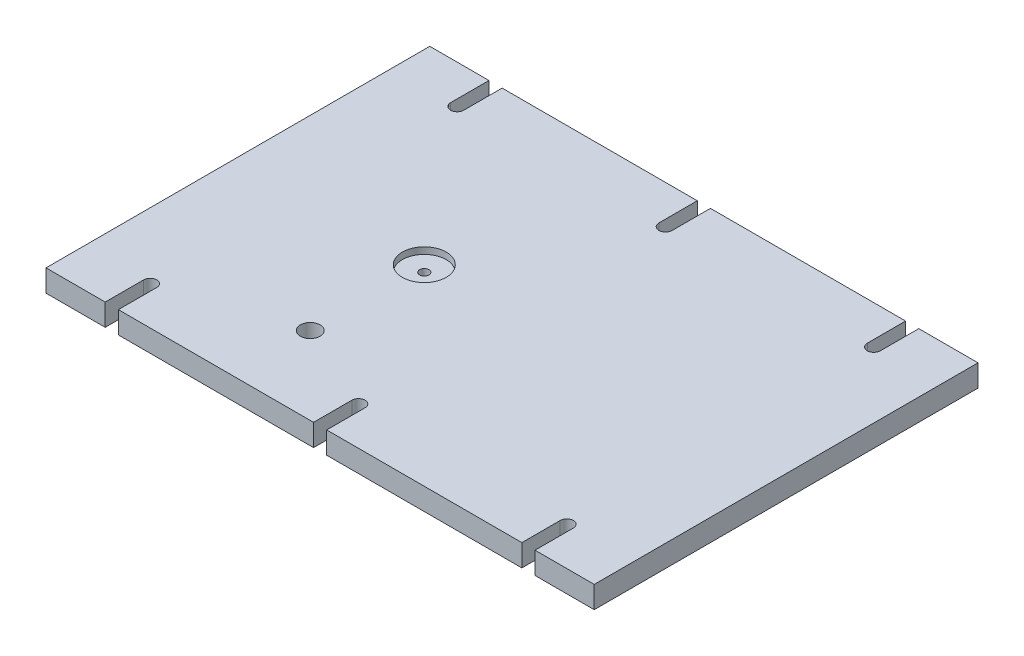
ISO-10303-21;
HEADER;
FILE_DESCRIPTION(('STEP AP214'),'2;1');
FILE_NAME('part.step','',(''),(''),'','','');
FILE_SCHEMA(('AUTOMOTIVE_DESIGN { 1 0 10303 214 1 1 1 1 }'));
ENDSEC;
DATA;
#1=APPLICATION_CONTEXT('core data for automotive mechanical design processes');
#2=APPLICATION_PROTOCOL_DEFINITION('international standard','automotive_design',2000,#1);
#3=PRODUCT_CONTEXT('',#1,'mechanical');
#4=PRODUCT('Part','Part','',(#3));
#5=PRODUCT_RELATED_PRODUCT_CATEGORY('part','',(#4));
#6=PRODUCT_DEFINITION_FORMATION('','',#4);
#7=PRODUCT_DEFINITION_CONTEXT('part definition',#1,'design');
#8=PRODUCT_DEFINITION('design','',#6,#7);
#9=PRODUCT_DEFINITION_SHAPE('','',#8);
#10=(LENGTH_UNIT() NAMED_UNIT(*) SI_UNIT(.MILLI.,.METRE.));
#11=(NAMED_UNIT(*) PLANE_ANGLE_UNIT() SI_UNIT($,.RADIAN.));
#12=(NAMED_UNIT(*) SI_UNIT($,.STERADIAN.) SOLID_ANGLE_UNIT());
#13=UNCERTAINTY_MEASURE_WITH_UNIT(LENGTH_MEASURE(1.E-05),#10,'distance_accuracy_value','');
#14=(GEOMETRIC_REPRESENTATION_CONTEXT(3) GLOBAL_UNCERTAINTY_ASSIGNED_CONTEXT((#13)) GLOBAL_UNIT_ASSIGNED_CONTEXT((#10,
#11,#12)) REPRESENTATION_CONTEXT('',''));
#15=CARTESIAN_POINT('',(0.,0.,0.));
#16=DIRECTION('',(0.,0.,1.));
#17=DIRECTION('',(1.,0.,0.));
#18=AXIS2_PLACEMENT_3D('',#15,#16,#17);
#19=CARTESIAN_POINT('',(-200.,-20.,-175.));
#20=DIRECTION('',(0.,0.,1.));
#21=DIRECTION('',(1.,0.,0.));
#22=AXIS2_PLACEMENT_3D('',#19,#20,#21);
#23=PLANE('',#22);
#24=DIRECTION('',(-1.,0.,0.));
#25=VECTOR('',#24,1.);
#26=CARTESIAN_POINT('',(-200.,0.,-175.));
#27=LINE('',#26,#25);
#28=CARTESIAN_POINT('',(43.9999999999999,0.,-175.));
#29=VERTEX_POINT('',#28);
#30=CARTESIAN_POINT('',(-134.,0.,-175.));
#31=VERTEX_POINT('',#30);
#32=EDGE_CURVE('E430',#29,#31,#27,.T.);
#33=ORIENTED_EDGE('',*,*,#32,.F.);
#34=DIRECTION('',(0.,1.,0.));
#35=VECTOR('',#34,1.);
#36=CARTESIAN_POINT('',(43.9999999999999,-20.,-175.));
#37=LINE('',#36,#35);
#38=CARTESIAN_POINT('',(43.9999999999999,-20.,-175.));
#39=VERTEX_POINT('',#38);
#40=EDGE_CURVE('E249',#39,#29,#37,.T.);
#41=ORIENTED_EDGE('',*,*,#40,.F.);
#42=DIRECTION('',(1.,0.,0.));
#43=VECTOR('',#42,1.);
#44=CARTESIAN_POINT('',(-200.,-20.,-175.));
#45=LINE('',#44,#43);
#46=CARTESIAN_POINT('',(-134.,-20.,-175.));
#47=VERTEX_POINT('',#46);
#48=EDGE_CURVE('E423',#47,#39,#45,.T.);
#49=ORIENTED_EDGE('',*,*,#48,.F.);
#50=DIRECTION('',(0.,1.,0.));
#51=VECTOR('',#50,1.);
#52=CARTESIAN_POINT('',(-134.,-20.,-175.));
#53=LINE('',#52,#51);
#54=EDGE_CURVE('E298',#47,#31,#53,.T.);
#55=ORIENTED_EDGE('',*,*,#54,.T.);
#56=EDGE_LOOP('',(#33,#41,#49,#55));
#57=FACE_BOUND('',#56,.T.);
#58=ADVANCED_FACE('F33',(#57),#23,.F.);
#59=CARTESIAN_POINT('',(-200.,-20.,175.));
#60=DIRECTION('',(0.,0.,1.));
#61=DIRECTION('',(1.,0.,0.));
#62=AXIS2_PLACEMENT_3D('',#59,#60,#61);
#63=PLANE('',#62);
#64=DIRECTION('',(0.,1.,0.));
#65=VECTOR('',#64,1.);
#66=CARTESIAN_POINT('',(44.,-20.,175.));
#67=LINE('',#66,#65);
#68=CARTESIAN_POINT('',(44.,-20.,175.));
#69=VERTEX_POINT('',#68);
#70=CARTESIAN_POINT('',(44.,0.,175.));
#71=VERTEX_POINT('',#70);
#72=EDGE_CURVE('E260',#69,#71,#67,.T.);
#73=ORIENTED_EDGE('',*,*,#72,.T.);
#74=DIRECTION('',(-1.,0.,0.));
#75=VECTOR('',#74,1.);
#76=CARTESIAN_POINT('',(-200.,0.,175.));
#77=LINE('',#76,#75);
#78=CARTESIAN_POINT('',(-134.,0.,175.));
#79=VERTEX_POINT('',#78);
#80=EDGE_CURVE('E415',#71,#79,#77,.T.);
#81=ORIENTED_EDGE('',*,*,#80,.T.);
#82=DIRECTION('',(0.,1.,0.));
#83=VECTOR('',#82,1.);
#84=CARTESIAN_POINT('',(-134.,-20.,175.));
#85=LINE('',#84,#83);
#86=CARTESIAN_POINT('',(-134.,-20.,175.));
#87=VERTEX_POINT('',#86);
#88=EDGE_CURVE('E377',#87,#79,#85,.T.);
#89=ORIENTED_EDGE('',*,*,#88,.F.);
#90=DIRECTION('',(1.,0.,0.));
#91=VECTOR('',#90,1.);
#92=CARTESIAN_POINT('',(-200.,-20.,175.));
#93=LINE('',#92,#91);
#94=EDGE_CURVE('E406',#87,#69,#93,.T.);
#95=ORIENTED_EDGE('',*,*,#94,.T.);
#96=EDGE_LOOP('',(#73,#81,#89,#95));
#97=FACE_BOUND('',#96,.T.);
#98=ADVANCED_FACE('F462',(#97),#63,.T.);
#99=CARTESIAN_POINT('',(-146.,0.,-175.));
#100=VERTEX_POINT('',#99);
#101=CARTESIAN_POINT('',(-200.,0.,-175.));
#102=VERTEX_POINT('',#101);
#103=EDGE_CURVE('E426',#100,#102,#27,.T.);
#104=ORIENTED_EDGE('',*,*,#103,.F.);
#105=DIRECTION('',(0.,1.,0.));
#106=VECTOR('',#105,1.);
#107=CARTESIAN_POINT('',(-146.,-20.,-175.));
#108=LINE('',#107,#106);
#109=CARTESIAN_POINT('',(-146.,-20.,-175.));
#110=VERTEX_POINT('',#109);
#111=EDGE_CURVE('E296',#110,#100,#108,.T.);
#112=ORIENTED_EDGE('',*,*,#111,.F.);
#113=CARTESIAN_POINT('',(-200.,-20.,-175.));
#114=VERTEX_POINT('',#113);
#115=EDGE_CURVE('E419',#114,#110,#45,.T.);
#116=ORIENTED_EDGE('',*,*,#115,.F.);
#117=DIRECTION('',(0.,-1.,0.));
#118=VECTOR('',#117,1.);
#119=CARTESIAN_POINT('',(-200.,0.,-175.));
#120=LINE('',#119,#118);
#121=EDGE_CURVE('E396',#102,#114,#120,.T.);
#122=ORIENTED_EDGE('',*,*,#121,.F.);
#123=EDGE_LOOP('',(#104,#112,#116,#122));
#124=FACE_BOUND('',#123,.T.);
#125=ADVANCED_FACE('F508',(#124),#23,.F.);
#126=CARTESIAN_POINT('',(55.9999999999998,-20.,-175.));
#127=VERTEX_POINT('',#126);
#128=CARTESIAN_POINT('',(234.,-20.,-175.));
#129=VERTEX_POINT('',#128);
#130=EDGE_CURVE('E424',#127,#129,#45,.T.);
#131=ORIENTED_EDGE('',*,*,#130,.F.);
#132=DIRECTION('',(0.,1.,0.));
#133=VECTOR('',#132,1.);
#134=CARTESIAN_POINT('',(55.9999999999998,-20.,-175.));
#135=LINE('',#134,#133);
#136=CARTESIAN_POINT('',(55.9999999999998,0.,-175.));
#137=VERTEX_POINT('',#136);
#138=EDGE_CURVE('E225',#127,#137,#135,.T.);
#139=ORIENTED_EDGE('',*,*,#138,.T.);
#140=CARTESIAN_POINT('',(234.,0.,-175.));
#141=VERTEX_POINT('',#140);
#142=EDGE_CURVE('E429',#141,#137,#27,.T.);
#143=ORIENTED_EDGE('',*,*,#142,.F.);
#144=DIRECTION('',(0.,1.,0.));
#145=VECTOR('',#144,1.);
#146=CARTESIAN_POINT('',(234.,-20.,-175.));
#147=LINE('',#146,#145);
#148=EDGE_CURVE('E323',#129,#141,#147,.T.);
#149=ORIENTED_EDGE('',*,*,#148,.F.);
#150=EDGE_LOOP('',(#131,#139,#143,#149));
#151=FACE_BOUND('',#150,.T.);
#152=ADVANCED_FACE('F517',(#151),#23,.F.);
#153=DIRECTION('',(0.,1.,0.));
#154=VECTOR('',#153,1.);
#155=CARTESIAN_POINT('',(246.,-20.,175.));
#156=LINE('',#155,#154);
#157=CARTESIAN_POINT('',(246.,-20.,175.));
#158=VERTEX_POINT('',#157);
#159=CARTESIAN_POINT('',(246.,0.,175.));
#160=VERTEX_POINT('',#159);
#161=EDGE_CURVE('E349',#158,#160,#156,.T.);
#162=ORIENTED_EDGE('',*,*,#161,.F.);
#163=CARTESIAN_POINT('',(300.,-20.,175.));
#164=VERTEX_POINT('',#163);
#165=EDGE_CURVE('E400',#158,#164,#93,.T.);
#166=ORIENTED_EDGE('',*,*,#165,.T.);
#167=DIRECTION('',(0.,1.,0.));
#168=VECTOR('',#167,1.);
#169=CARTESIAN_POINT('',(300.,0.,175.));
#170=LINE('',#169,#168);
#171=CARTESIAN_POINT('',(300.,0.,175.));
#172=VERTEX_POINT('',#171);
#173=EDGE_CURVE('E405',#164,#172,#170,.T.);
#174=ORIENTED_EDGE('',*,*,#173,.T.);
#175=EDGE_CURVE('E410',#172,#160,#77,.T.);
#176=ORIENTED_EDGE('',*,*,#175,.T.);
#177=EDGE_LOOP('',(#162,#166,#174,#176));
#178=FACE_BOUND('',#177,.T.);
#179=ADVANCED_FACE('F457',(#178),#63,.T.);
#180=DIRECTION('',(0.,1.,0.));
#181=VECTOR('',#180,1.);
#182=CARTESIAN_POINT('',(-146.,-20.,175.));
#183=LINE('',#182,#181);
#184=CARTESIAN_POINT('',(-146.,-20.,175.));
#185=VERTEX_POINT('',#184);
#186=CARTESIAN_POINT('',(-146.,0.,175.));
#187=VERTEX_POINT('',#186);
#188=EDGE_CURVE('E365',#185,#187,#183,.T.);
#189=ORIENTED_EDGE('',*,*,#188,.T.);
#190=CARTESIAN_POINT('',(-200.,0.,175.));
#191=VERTEX_POINT('',#190);
#192=EDGE_CURVE('E409',#187,#191,#77,.T.);
#193=ORIENTED_EDGE('',*,*,#192,.T.);
#194=DIRECTION('',(0.,-1.,0.));
#195=VECTOR('',#194,1.);
#196=CARTESIAN_POINT('',(-200.,0.,175.));
#197=LINE('',#196,#195);
#198=CARTESIAN_POINT('',(-200.,-20.,175.));
#199=VERTEX_POINT('',#198);
#200=EDGE_CURVE('E397',#191,#199,#197,.T.);
#201=ORIENTED_EDGE('',*,*,#200,.T.);
#202=EDGE_CURVE('E402',#199,#185,#93,.T.);
#203=ORIENTED_EDGE('',*,*,#202,.T.);
#204=EDGE_LOOP('',(#189,#193,#201,#203));
#205=FACE_BOUND('',#204,.T.);
#206=ADVANCED_FACE('F477',(#205),#63,.T.);
#207=CARTESIAN_POINT('',(-30.,0.,0.));
#208=DIRECTION('',(0.,1.,0.));
#209=DIRECTION('',(0.,0.,1.));
#210=AXIS2_PLACEMENT_3D('',#207,#208,#209);
#211=CYLINDRICAL_SURFACE('',#210,4.24999999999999);
#212=CARTESIAN_POINT('',(-30.,-20.,0.));
#213=DIRECTION('',(0.,1.,0.));
#214=DIRECTION('',(0.,0.,1.));
#215=AXIS2_PLACEMENT_3D('',#212,#213,#214);
#216=CIRCLE('',#215,4.25);
#217=CARTESIAN_POINT('',(-30.,-20.,4.24999999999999));
#218=VERTEX_POINT('',#217);
#219=EDGE_CURVE('E390',#218,#218,#216,.T.);
#220=ORIENTED_EDGE('',*,*,#219,.F.);
#221=EDGE_LOOP('',(#220));
#222=FACE_BOUND('',#221,.T.);
#223=CARTESIAN_POINT('',(-30.,-6.,0.));
#224=DIRECTION('',(0.,1.,0.));
#225=DIRECTION('',(0.,0.,1.));
#226=AXIS2_PLACEMENT_3D('',#223,#224,#225);
#227=CIRCLE('',#226,4.24999999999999);
#228=CARTESIAN_POINT('',(-30.,-6.,4.24999999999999));
#229=VERTEX_POINT('',#228);
#230=EDGE_CURVE('E37',#229,#229,#227,.F.);
#231=ORIENTED_EDGE('',*,*,#230,.F.);
#232=EDGE_LOOP('',(#231));
#233=FACE_BOUND('',#232,.T.);
#234=ADVANCED_FACE('F730',(#222,#233),#211,.F.);
#235=CARTESIAN_POINT('',(-200.,0.,175.));
#236=DIRECTION('',(1.,0.,0.));
#237=DIRECTION('',(0.,0.,-1.));
#238=AXIS2_PLACEMENT_3D('',#235,#236,#237);
#239=PLANE('',#238);
#240=ORIENTED_EDGE('',*,*,#121,.T.);
#241=DIRECTION('',(0.,0.,-1.));
#242=VECTOR('',#241,1.);
#243=CARTESIAN_POINT('',(-200.,-20.,175.));
#244=LINE('',#243,#242);
#245=EDGE_CURVE('E11',#199,#114,#244,.T.);
#246=ORIENTED_EDGE('',*,*,#245,.F.);
#247=ORIENTED_EDGE('',*,*,#200,.F.);
#248=DIRECTION('',(0.,0.,-1.));
#249=VECTOR('',#248,1.);
#250=CARTESIAN_POINT('',(-200.,0.,175.));
#251=LINE('',#250,#249);
#252=EDGE_CURVE('E413',#191,#102,#251,.T.);
#253=ORIENTED_EDGE('',*,*,#252,.T.);
#254=EDGE_LOOP('',(#240,#246,#247,#253));
#255=FACE_BOUND('',#254,.T.);
#256=ADVANCED_FACE('F35',(#255),#239,.F.);
#257=CARTESIAN_POINT('',(-200.,-20.,175.));
#258=DIRECTION('',(0.,1.,0.));
#259=DIRECTION('',(0.,0.,1.));
#260=AXIS2_PLACEMENT_3D('',#257,#258,#259);
#261=PLANE('',#260);
#262=CARTESIAN_POINT('',(-30.,-20.,104.));
#263=DIRECTION('',(0.,1.,0.));
#264=DIRECTION('',(0.,0.,1.));
#265=AXIS2_PLACEMENT_3D('',#262,#263,#264);
#266=CIRCLE('',#265,8.99999999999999);
#267=CARTESIAN_POINT('',(-30.,-20.,113.));
#268=VERTEX_POINT('',#267);
#269=EDGE_CURVE('E387',#268,#268,#266,.T.);
#270=ORIENTED_EDGE('',*,*,#269,.T.);
#271=EDGE_LOOP('',(#270));
#272=FACE_BOUND('',#271,.T.);
#273=ORIENTED_EDGE('',*,*,#219,.T.);
#274=EDGE_LOOP('',(#273));
#275=FACE_BOUND('',#274,.T.);
#276=ORIENTED_EDGE('',*,*,#48,.T.);
#277=DIRECTION('',(0.,0.,1.));
#278=VECTOR('',#277,1.);
#279=CARTESIAN_POINT('',(43.9999999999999,-20.,-175.));
#280=LINE('',#279,#278);
#281=CARTESIAN_POINT('',(44.,-20.,-140.));
#282=VERTEX_POINT('',#281);
#283=EDGE_CURVE('E226',#39,#282,#280,.T.);
#284=ORIENTED_EDGE('',*,*,#283,.T.);
#285=CARTESIAN_POINT('',(50.,-20.,-140.));
#286=DIRECTION('',(0.,1.,0.));
#287=DIRECTION('',(0.,0.,-1.));
#288=AXIS2_PLACEMENT_3D('',#285,#286,#287);
#289=CIRCLE('',#288,6.00000000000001);
#290=CARTESIAN_POINT('',(56.,-20.,-140.));
#291=VERTEX_POINT('',#290);
#292=EDGE_CURVE('E221',#282,#291,#289,.T.);
#293=ORIENTED_EDGE('',*,*,#292,.T.);
#294=DIRECTION('',(0.,0.,-1.));
#295=VECTOR('',#294,1.);
#296=CARTESIAN_POINT('',(55.9999999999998,-20.,-175.));
#297=LINE('',#296,#295);
#298=EDGE_CURVE('E229',#291,#127,#297,.T.);
#299=ORIENTED_EDGE('',*,*,#298,.T.);
#300=ORIENTED_EDGE('',*,*,#130,.T.);
#301=DIRECTION('',(0.,0.,1.));
#302=VECTOR('',#301,1.);
#303=CARTESIAN_POINT('',(234.,-20.,-175.));
#304=LINE('',#303,#302);
#305=CARTESIAN_POINT('',(234.,-20.,-140.));
#306=VERTEX_POINT('',#305);
#307=EDGE_CURVE('E310',#129,#306,#304,.T.);
#308=ORIENTED_EDGE('',*,*,#307,.T.);
#309=CARTESIAN_POINT('',(240.,-20.,-140.));
#310=DIRECTION('',(0.,1.,0.));
#311=DIRECTION('',(0.,0.,-1.));
#312=AXIS2_PLACEMENT_3D('',#309,#310,#311);
#313=CIRCLE('',#312,6.00000000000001);
#314=CARTESIAN_POINT('',(246.,-20.,-140.));
#315=VERTEX_POINT('',#314);
#316=EDGE_CURVE('E303',#306,#315,#313,.T.);
#317=ORIENTED_EDGE('',*,*,#316,.T.);
#318=DIRECTION('',(0.,0.,-1.));
#319=VECTOR('',#318,1.);
#320=CARTESIAN_POINT('',(246.,-20.,-175.));
#321=LINE('',#320,#319);
#322=CARTESIAN_POINT('',(246.,-20.,-175.));
#323=VERTEX_POINT('',#322);
#324=EDGE_CURVE('E306',#315,#323,#321,.T.);
#325=ORIENTED_EDGE('',*,*,#324,.T.);
#326=CARTESIAN_POINT('',(300.,-20.,-175.));
#327=VERTEX_POINT('',#326);
#328=EDGE_CURVE('E418',#323,#327,#45,.T.);
#329=ORIENTED_EDGE('',*,*,#328,.T.);
#330=DIRECTION('',(0.,0.,-1.));
#331=VECTOR('',#330,1.);
#332=CARTESIAN_POINT('',(300.,-20.,175.));
#333=LINE('',#332,#331);
#334=EDGE_CURVE('E42',#164,#327,#333,.T.);
#335=ORIENTED_EDGE('',*,*,#334,.F.);
#336=ORIENTED_EDGE('',*,*,#165,.F.);
#337=DIRECTION('',(0.,0.,-1.));
#338=VECTOR('',#337,1.);
#339=CARTESIAN_POINT('',(246.,-20.,175.));
#340=LINE('',#339,#338);
#341=CARTESIAN_POINT('',(246.,-20.,140.));
#342=VERTEX_POINT('',#341);
#343=EDGE_CURVE('E336',#158,#342,#340,.T.);
#344=ORIENTED_EDGE('',*,*,#343,.T.);
#345=CARTESIAN_POINT('',(240.,-20.,140.));
#346=DIRECTION('',(0.,1.,0.));
#347=DIRECTION('',(0.,0.,1.));
#348=AXIS2_PLACEMENT_3D('',#345,#346,#347);
#349=CIRCLE('',#348,6.00000000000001);
#350=CARTESIAN_POINT('',(234.,-20.,140.));
#351=VERTEX_POINT('',#350);
#352=EDGE_CURVE('E329',#342,#351,#349,.T.);
#353=ORIENTED_EDGE('',*,*,#352,.T.);
#354=DIRECTION('',(0.,0.,1.));
#355=VECTOR('',#354,1.);
#356=CARTESIAN_POINT('',(234.,-20.,175.));
#357=LINE('',#356,#355);
#358=CARTESIAN_POINT('',(234.,-20.,175.));
#359=VERTEX_POINT('',#358);
#360=EDGE_CURVE('E332',#351,#359,#357,.T.);
#361=ORIENTED_EDGE('',*,*,#360,.T.);
#362=CARTESIAN_POINT('',(56.,-20.,175.));
#363=VERTEX_POINT('',#362);
#364=EDGE_CURVE('E407',#363,#359,#93,.T.);
#365=ORIENTED_EDGE('',*,*,#364,.F.);
#366=DIRECTION('',(0.,0.,-1.));
#367=VECTOR('',#366,1.);
#368=CARTESIAN_POINT('',(56.,-20.,175.));
#369=LINE('',#368,#367);
#370=CARTESIAN_POINT('',(56.,-20.,140.));
#371=VERTEX_POINT('',#370);
#372=EDGE_CURVE('E57',#363,#371,#369,.T.);
#373=ORIENTED_EDGE('',*,*,#372,.T.);
#374=CARTESIAN_POINT('',(50.,-20.,140.));
#375=DIRECTION('',(0.,1.,0.));
#376=DIRECTION('',(0.,0.,1.));
#377=AXIS2_PLACEMENT_3D('',#374,#375,#376);
#378=CIRCLE('',#377,6.00000000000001);
#379=CARTESIAN_POINT('',(44.,-20.,140.));
#380=VERTEX_POINT('',#379);
#381=EDGE_CURVE('E257',#371,#380,#378,.T.);
#382=ORIENTED_EDGE('',*,*,#381,.T.);
#383=DIRECTION('',(0.,0.,1.));
#384=VECTOR('',#383,1.);
#385=CARTESIAN_POINT('',(44.,-20.,175.));
#386=LINE('',#385,#384);
#387=EDGE_CURVE('E252',#380,#69,#386,.T.);
#388=ORIENTED_EDGE('',*,*,#387,.T.);
#389=ORIENTED_EDGE('',*,*,#94,.F.);
#390=DIRECTION('',(0.,0.,-1.));
#391=VECTOR('',#390,1.);
#392=CARTESIAN_POINT('',(-134.,-20.,175.));
#393=LINE('',#392,#391);
#394=CARTESIAN_POINT('',(-134.,-20.,140.));
#395=VERTEX_POINT('',#394);
#396=EDGE_CURVE('E358',#87,#395,#393,.T.);
#397=ORIENTED_EDGE('',*,*,#396,.T.);
#398=CARTESIAN_POINT('',(-140.,-20.,140.));
#399=DIRECTION('',(0.,1.,0.));
#400=DIRECTION('',(0.,0.,-1.));
#401=AXIS2_PLACEMENT_3D('',#398,#399,#400);
#402=CIRCLE('',#401,6.00000000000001);
#403=CARTESIAN_POINT('',(-146.,-20.,140.));
#404=VERTEX_POINT('',#403);
#405=EDGE_CURVE('E362',#395,#404,#402,.T.);
#406=ORIENTED_EDGE('',*,*,#405,.T.);
#407=DIRECTION('',(0.,0.,1.));
#408=VECTOR('',#407,1.);
#409=CARTESIAN_POINT('',(-146.,-20.,175.));
#410=LINE('',#409,#408);
#411=EDGE_CURVE('E355',#404,#185,#410,.T.);
#412=ORIENTED_EDGE('',*,*,#411,.T.);
#413=ORIENTED_EDGE('',*,*,#202,.F.);
#414=ORIENTED_EDGE('',*,*,#245,.T.);
#415=ORIENTED_EDGE('',*,*,#115,.T.);
#416=DIRECTION('',(0.,0.,1.));
#417=VECTOR('',#416,1.);
#418=CARTESIAN_POINT('',(-146.,-20.,-175.));
#419=LINE('',#418,#417);
#420=CARTESIAN_POINT('',(-146.,-20.,-140.));
#421=VERTEX_POINT('',#420);
#422=EDGE_CURVE('E283',#110,#421,#419,.T.);
#423=ORIENTED_EDGE('',*,*,#422,.T.);
#424=CARTESIAN_POINT('',(-140.,-20.,-140.));
#425=DIRECTION('',(0.,1.,0.));
#426=DIRECTION('',(0.,0.,1.));
#427=AXIS2_PLACEMENT_3D('',#424,#425,#426);
#428=CIRCLE('',#427,6.00000000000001);
#429=CARTESIAN_POINT('',(-134.,-20.,-140.));
#430=VERTEX_POINT('',#429);
#431=EDGE_CURVE('E276',#421,#430,#428,.T.);
#432=ORIENTED_EDGE('',*,*,#431,.T.);
#433=DIRECTION('',(0.,0.,-1.));
#434=VECTOR('',#433,1.);
#435=CARTESIAN_POINT('',(-134.,-20.,-175.));
#436=LINE('',#435,#434);
#437=EDGE_CURVE('E279',#430,#47,#436,.T.);
#438=ORIENTED_EDGE('',*,*,#437,.T.);
#439=EDGE_LOOP('',(#276,#284,#293,#299,#300,#308,#317,#325,#329,#335,#336,#344,#353,#361,#365,
#373,#382,#388,#389,#397,#406,#412,#413,#414,#415,#423,#432,#438));
#440=FACE_BOUND('',#439,.T.);
#441=ADVANCED_FACE('F236',(#272,#275,#440),#261,.F.);
#442=CARTESIAN_POINT('',(300.,0.,175.));
#443=DIRECTION('',(-1.,0.,0.));
#444=DIRECTION('',(0.,0.,1.));
#445=AXIS2_PLACEMENT_3D('',#442,#443,#444);
#446=PLANE('',#445);
#447=DIRECTION('',(0.,1.,0.));
#448=VECTOR('',#447,1.);
#449=CARTESIAN_POINT('',(300.,0.,-175.));
#450=LINE('',#449,#448);
#451=CARTESIAN_POINT('',(300.,0.,-175.));
#452=VERTEX_POINT('',#451);
#453=EDGE_CURVE('E422',#327,#452,#450,.T.);
#454=ORIENTED_EDGE('',*,*,#453,.T.);
#455=DIRECTION('',(0.,0.,-1.));
#456=VECTOR('',#455,1.);
#457=CARTESIAN_POINT('',(300.,0.,175.));
#458=LINE('',#457,#456);
#459=EDGE_CURVE('E433',#172,#452,#458,.T.);
#460=ORIENTED_EDGE('',*,*,#459,.F.);
#461=ORIENTED_EDGE('',*,*,#173,.F.);
#462=ORIENTED_EDGE('',*,*,#334,.T.);
#463=EDGE_LOOP('',(#454,#460,#461,#462));
#464=FACE_BOUND('',#463,.T.);
#465=ADVANCED_FACE('F441',(#464),#446,.F.);
#466=CARTESIAN_POINT('',(-200.,0.,175.));
#467=DIRECTION('',(0.,-1.,0.));
#468=DIRECTION('',(0.,0.,-1.));
#469=AXIS2_PLACEMENT_3D('',#466,#467,#468);
#470=PLANE('',#469);
#471=CARTESIAN_POINT('',(-30.,0.,0.));
#472=DIRECTION('',(0.,1.,0.));
#473=DIRECTION('',(0.,0.,1.));
#474=AXIS2_PLACEMENT_3D('',#471,#472,#473);
#475=CIRCLE('',#474,20.);
#476=CARTESIAN_POINT('',(-30.,0.,20.));
#477=VERTEX_POINT('',#476);
#478=EDGE_CURVE('E374',#477,#477,#475,.T.);
#479=ORIENTED_EDGE('',*,*,#478,.F.);
#480=EDGE_LOOP('',(#479));
#481=FACE_BOUND('',#480,.T.);
#482=CARTESIAN_POINT('',(-30.,0.,104.));
#483=DIRECTION('',(0.,1.,0.));
#484=DIRECTION('',(0.,0.,1.));
#485=AXIS2_PLACEMENT_3D('',#482,#483,#484);
#486=CIRCLE('',#485,8.99999999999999);
#487=CARTESIAN_POINT('',(-30.,0.,113.));
#488=VERTEX_POINT('',#487);
#489=EDGE_CURVE('E391',#488,#488,#486,.T.);
#490=ORIENTED_EDGE('',*,*,#489,.F.);
#491=EDGE_LOOP('',(#490));
#492=FACE_BOUND('',#491,.T.);
#493=CARTESIAN_POINT('',(50.,0.,-140.));
#494=DIRECTION('',(0.,1.,0.));
#495=DIRECTION('',(0.,0.,-1.));
#496=AXIS2_PLACEMENT_3D('',#493,#494,#495);
#497=CIRCLE('',#496,6.00000000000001);
#498=CARTESIAN_POINT('',(44.,0.,-140.));
#499=VERTEX_POINT('',#498);
#500=CARTESIAN_POINT('',(56.,0.,-140.));
#501=VERTEX_POINT('',#500);
#502=EDGE_CURVE('E49',#499,#501,#497,.T.);
#503=ORIENTED_EDGE('',*,*,#502,.F.);
#504=DIRECTION('',(0.,0.,1.));
#505=VECTOR('',#504,1.);
#506=CARTESIAN_POINT('',(43.9999999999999,0.,-175.));
#507=LINE('',#506,#505);
#508=EDGE_CURVE('E237',#29,#499,#507,.T.);
#509=ORIENTED_EDGE('',*,*,#508,.F.);
#510=ORIENTED_EDGE('',*,*,#32,.T.);
#511=DIRECTION('',(0.,0.,-1.));
#512=VECTOR('',#511,1.);
#513=CARTESIAN_POINT('',(-134.,0.,-175.));
#514=LINE('',#513,#512);
#515=CARTESIAN_POINT('',(-134.,0.,-140.));
#516=VERTEX_POINT('',#515);
#517=EDGE_CURVE('E288',#516,#31,#514,.T.);
#518=ORIENTED_EDGE('',*,*,#517,.F.);
#519=CARTESIAN_POINT('',(-140.,0.,-140.));
#520=DIRECTION('',(0.,1.,0.));
#521=DIRECTION('',(0.,0.,1.));
#522=AXIS2_PLACEMENT_3D('',#519,#520,#521);
#523=CIRCLE('',#522,6.00000000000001);
#524=CARTESIAN_POINT('',(-146.,0.,-140.));
#525=VERTEX_POINT('',#524);
#526=EDGE_CURVE('E269',#525,#516,#523,.T.);
#527=ORIENTED_EDGE('',*,*,#526,.F.);
#528=DIRECTION('',(0.,0.,1.));
#529=VECTOR('',#528,1.);
#530=CARTESIAN_POINT('',(-146.,0.,-175.));
#531=LINE('',#530,#529);
#532=EDGE_CURVE('E280',#100,#525,#531,.T.);
#533=ORIENTED_EDGE('',*,*,#532,.F.);
#534=ORIENTED_EDGE('',*,*,#103,.T.);
#535=ORIENTED_EDGE('',*,*,#252,.F.);
#536=ORIENTED_EDGE('',*,*,#192,.F.);
#537=DIRECTION('',(0.,0.,1.));
#538=VECTOR('',#537,1.);
#539=CARTESIAN_POINT('',(-146.,0.,175.));
#540=LINE('',#539,#538);
#541=CARTESIAN_POINT('',(-146.,0.,140.));
#542=VERTEX_POINT('',#541);
#543=EDGE_CURVE('E348',#542,#187,#540,.T.);
#544=ORIENTED_EDGE('',*,*,#543,.F.);
#545=CARTESIAN_POINT('',(-140.,0.,140.));
#546=DIRECTION('',(0.,1.,0.));
#547=DIRECTION('',(0.,0.,-1.));
#548=AXIS2_PLACEMENT_3D('',#545,#546,#547);
#549=CIRCLE('',#548,6.00000000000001);
#550=CARTESIAN_POINT('',(-134.,0.,140.));
#551=VERTEX_POINT('',#550);
#552=EDGE_CURVE('E359',#551,#542,#549,.T.);
#553=ORIENTED_EDGE('',*,*,#552,.F.);
#554=DIRECTION('',(0.,0.,-1.));
#555=VECTOR('',#554,1.);
#556=CARTESIAN_POINT('',(-134.,0.,175.));
#557=LINE('',#556,#555);
#558=EDGE_CURVE('E367',#79,#551,#557,.T.);
#559=ORIENTED_EDGE('',*,*,#558,.F.);
#560=ORIENTED_EDGE('',*,*,#80,.F.);
#561=DIRECTION('',(0.,0.,1.));
#562=VECTOR('',#561,1.);
#563=CARTESIAN_POINT('',(44.,0.,175.));
#564=LINE('',#563,#562);
#565=CARTESIAN_POINT('',(44.,0.,140.));
#566=VERTEX_POINT('',#565);
#567=EDGE_CURVE('E248',#566,#71,#564,.T.);
#568=ORIENTED_EDGE('',*,*,#567,.F.);
#569=CARTESIAN_POINT('',(50.,0.,140.));
#570=DIRECTION('',(0.,1.,0.));
#571=DIRECTION('',(0.,0.,1.));
#572=AXIS2_PLACEMENT_3D('',#569,#570,#571);
#573=CIRCLE('',#572,6.00000000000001);
#574=CARTESIAN_POINT('',(56.,0.,140.));
#575=VERTEX_POINT('',#574);
#576=EDGE_CURVE('E255',#575,#566,#573,.T.);
#577=ORIENTED_EDGE('',*,*,#576,.F.);
#578=DIRECTION('',(0.,0.,-1.));
#579=VECTOR('',#578,1.);
#580=CARTESIAN_POINT('',(56.,0.,175.));
#581=LINE('',#580,#579);
#582=CARTESIAN_POINT('',(56.,0.,175.));
#583=VERTEX_POINT('',#582);
#584=EDGE_CURVE('E262',#583,#575,#581,.T.);
#585=ORIENTED_EDGE('',*,*,#584,.F.);
#586=CARTESIAN_POINT('',(234.,0.,175.));
#587=VERTEX_POINT('',#586);
#588=EDGE_CURVE('E414',#587,#583,#77,.T.);
#589=ORIENTED_EDGE('',*,*,#588,.F.);
#590=DIRECTION('',(0.,0.,1.));
#591=VECTOR('',#590,1.);
#592=CARTESIAN_POINT('',(234.,0.,175.));
#593=LINE('',#592,#591);
#594=CARTESIAN_POINT('',(234.,0.,140.));
#595=VERTEX_POINT('',#594);
#596=EDGE_CURVE('E342',#595,#587,#593,.T.);
#597=ORIENTED_EDGE('',*,*,#596,.F.);
#598=CARTESIAN_POINT('',(240.,0.,140.));
#599=DIRECTION('',(0.,1.,0.));
#600=DIRECTION('',(0.,0.,1.));
#601=AXIS2_PLACEMENT_3D('',#598,#599,#600);
#602=CIRCLE('',#601,6.00000000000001);
#603=CARTESIAN_POINT('',(246.,0.,140.));
#604=VERTEX_POINT('',#603);
#605=EDGE_CURVE('E322',#604,#595,#602,.T.);
#606=ORIENTED_EDGE('',*,*,#605,.F.);
#607=DIRECTION('',(0.,0.,-1.));
#608=VECTOR('',#607,1.);
#609=CARTESIAN_POINT('',(246.,0.,175.));
#610=LINE('',#609,#608);
#611=EDGE_CURVE('E333',#160,#604,#610,.T.);
#612=ORIENTED_EDGE('',*,*,#611,.F.);
#613=ORIENTED_EDGE('',*,*,#175,.F.);
#614=ORIENTED_EDGE('',*,*,#459,.T.);
#615=CARTESIAN_POINT('',(246.,0.,-175.));
#616=VERTEX_POINT('',#615);
#617=EDGE_CURVE('E401',#452,#616,#27,.T.);
#618=ORIENTED_EDGE('',*,*,#617,.T.);
#619=DIRECTION('',(0.,0.,-1.));
#620=VECTOR('',#619,1.);
#621=CARTESIAN_POINT('',(246.,0.,-175.));
#622=LINE('',#621,#620);
#623=CARTESIAN_POINT('',(246.,0.,-140.));
#624=VERTEX_POINT('',#623);
#625=EDGE_CURVE('E316',#624,#616,#622,.T.);
#626=ORIENTED_EDGE('',*,*,#625,.F.);
#627=CARTESIAN_POINT('',(240.,0.,-140.));
#628=DIRECTION('',(0.,1.,0.));
#629=DIRECTION('',(0.,0.,-1.));
#630=AXIS2_PLACEMENT_3D('',#627,#628,#629);
#631=CIRCLE('',#630,6.00000000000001);
#632=CARTESIAN_POINT('',(234.,0.,-140.));
#633=VERTEX_POINT('',#632);
#634=EDGE_CURVE('E295',#633,#624,#631,.T.);
#635=ORIENTED_EDGE('',*,*,#634,.F.);
#636=DIRECTION('',(0.,0.,1.));
#637=VECTOR('',#636,1.);
#638=CARTESIAN_POINT('',(234.,0.,-175.));
#639=LINE('',#638,#637);
#640=EDGE_CURVE('E307',#141,#633,#639,.T.);
#641=ORIENTED_EDGE('',*,*,#640,.F.);
#642=ORIENTED_EDGE('',*,*,#142,.T.);
#643=DIRECTION('',(0.,0.,-1.));
#644=VECTOR('',#643,1.);
#645=CARTESIAN_POINT('',(55.9999999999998,0.,-175.));
#646=LINE('',#645,#644);
#647=EDGE_CURVE('E240',#501,#137,#646,.T.);
#648=ORIENTED_EDGE('',*,*,#647,.F.);
#649=EDGE_LOOP('',(#503,#509,#510,#518,#527,#533,#534,#535,#536,#544,#553,#559,#560,#568,#577,
#585,#589,#597,#606,#612,#613,#614,#618,#626,#635,#641,#642,#648));
#650=FACE_BOUND('',#649,.T.);
#651=ADVANCED_FACE('F450',(#481,#492,#650),#470,.F.);
#652=DIRECTION('',(0.,1.,0.));
#653=VECTOR('',#652,1.);
#654=CARTESIAN_POINT('',(56.,-20.,175.));
#655=LINE('',#654,#653);
#656=EDGE_CURVE('E272',#363,#583,#655,.T.);
#657=ORIENTED_EDGE('',*,*,#656,.F.);
#658=ORIENTED_EDGE('',*,*,#364,.T.);
#659=DIRECTION('',(0.,1.,0.));
#660=VECTOR('',#659,1.);
#661=CARTESIAN_POINT('',(234.,-20.,175.));
#662=LINE('',#661,#660);
#663=EDGE_CURVE('E351',#359,#587,#662,.T.);
#664=ORIENTED_EDGE('',*,*,#663,.T.);
#665=ORIENTED_EDGE('',*,*,#588,.T.);
#666=EDGE_LOOP('',(#657,#658,#664,#665));
#667=FACE_BOUND('',#666,.T.);
#668=ADVANCED_FACE('F513',(#667),#63,.T.);
#669=ORIENTED_EDGE('',*,*,#328,.F.);
#670=DIRECTION('',(0.,1.,0.));
#671=VECTOR('',#670,1.);
#672=CARTESIAN_POINT('',(246.,-20.,-175.));
#673=LINE('',#672,#671);
#674=EDGE_CURVE('E325',#323,#616,#673,.T.);
#675=ORIENTED_EDGE('',*,*,#674,.T.);
#676=ORIENTED_EDGE('',*,*,#617,.F.);
#677=ORIENTED_EDGE('',*,*,#453,.F.);
#678=EDGE_LOOP('',(#669,#675,#676,#677));
#679=FACE_BOUND('',#678,.T.);
#680=ADVANCED_FACE('F447',(#679),#23,.F.);
#681=CARTESIAN_POINT('',(-30.,-20.,104.));
#682=DIRECTION('',(0.,1.,0.));
#683=DIRECTION('',(0.,0.,1.));
#684=AXIS2_PLACEMENT_3D('',#681,#682,#683);
#685=CYLINDRICAL_SURFACE('',#684,8.99999999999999);
#686=ORIENTED_EDGE('',*,*,#269,.F.);
#687=EDGE_LOOP('',(#686));
#688=FACE_BOUND('',#687,.T.);
#689=ORIENTED_EDGE('',*,*,#489,.T.);
#690=EDGE_LOOP('',(#689));
#691=FACE_BOUND('',#690,.T.);
#692=ADVANCED_FACE('F520',(#688,#691),#685,.F.);
#693=CARTESIAN_POINT('',(-30.,-6.,0.));
#694=DIRECTION('',(0.,1.,0.));
#695=DIRECTION('',(0.,0.,1.));
#696=AXIS2_PLACEMENT_3D('',#693,#694,#695);
#697=PLANE('',#696);
#698=CARTESIAN_POINT('',(-30.,-6.,0.));
#699=DIRECTION('',(0.,1.,0.));
#700=DIRECTION('',(0.,0.,1.));
#701=AXIS2_PLACEMENT_3D('',#698,#699,#700);
#702=CIRCLE('',#701,20.);
#703=CARTESIAN_POINT('',(-30.,-6.,20.));
#704=VERTEX_POINT('',#703);
#705=EDGE_CURVE('E382',#704,#704,#702,.T.);
#706=ORIENTED_EDGE('',*,*,#705,.T.);
#707=EDGE_LOOP('',(#706));
#708=FACE_BOUND('',#707,.T.);
#709=ORIENTED_EDGE('',*,*,#230,.T.);
#710=EDGE_LOOP('',(#709));
#711=FACE_BOUND('',#710,.T.);
#712=ADVANCED_FACE('F525',(#708,#711),#697,.T.);
#713=CARTESIAN_POINT('',(-30.,-6.,0.));
#714=DIRECTION('',(0.,1.,0.));
#715=DIRECTION('',(0.,0.,1.));
#716=AXIS2_PLACEMENT_3D('',#713,#714,#715);
#717=CYLINDRICAL_SURFACE('',#716,20.);
#718=ORIENTED_EDGE('',*,*,#705,.F.);
#719=EDGE_LOOP('',(#718));
#720=FACE_BOUND('',#719,.T.);
#721=ORIENTED_EDGE('',*,*,#478,.T.);
#722=EDGE_LOOP('',(#721));
#723=FACE_BOUND('',#722,.T.);
#724=ADVANCED_FACE('F699',(#720,#723),#717,.F.);
#725=CARTESIAN_POINT('',(-146.,-20.,175.));
#726=DIRECTION('',(-1.,0.,0.));
#727=DIRECTION('',(0.,0.,1.));
#728=AXIS2_PLACEMENT_3D('',#725,#726,#727);
#729=PLANE('',#728);
#730=ORIENTED_EDGE('',*,*,#543,.T.);
#731=ORIENTED_EDGE('',*,*,#188,.F.);
#732=ORIENTED_EDGE('',*,*,#411,.F.);
#733=DIRECTION('',(0.,1.,0.));
#734=VECTOR('',#733,1.);
#735=CARTESIAN_POINT('',(-146.,-20.,140.));
#736=LINE('',#735,#734);
#737=EDGE_CURVE('E372',#404,#542,#736,.T.);
#738=ORIENTED_EDGE('',*,*,#737,.T.);
#739=EDGE_LOOP('',(#730,#731,#732,#738));
#740=FACE_BOUND('',#739,.T.);
#741=ADVANCED_FACE('F488',(#740),#729,.F.);
#742=CARTESIAN_POINT('',(-140.,-20.,140.));
#743=DIRECTION('',(0.,1.,0.));
#744=DIRECTION('',(0.,0.,1.));
#745=AXIS2_PLACEMENT_3D('',#742,#743,#744);
#746=CYLINDRICAL_SURFACE('',#745,6.00000000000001);
#747=ORIENTED_EDGE('',*,*,#552,.T.);
#748=ORIENTED_EDGE('',*,*,#737,.F.);
#749=ORIENTED_EDGE('',*,*,#405,.F.);
#750=DIRECTION('',(0.,1.,0.));
#751=VECTOR('',#750,1.);
#752=CARTESIAN_POINT('',(-134.,-20.,140.));
#753=LINE('',#752,#751);
#754=EDGE_CURVE('E375',#395,#551,#753,.T.);
#755=ORIENTED_EDGE('',*,*,#754,.T.);
#756=EDGE_LOOP('',(#747,#748,#749,#755));
#757=FACE_BOUND('',#756,.T.);
#758=ADVANCED_FACE('F490',(#757),#746,.F.);
#759=CARTESIAN_POINT('',(-134.,-20.,175.));
#760=DIRECTION('',(1.,0.,0.));
#761=DIRECTION('',(0.,0.,-1.));
#762=AXIS2_PLACEMENT_3D('',#759,#760,#761);
#763=PLANE('',#762);
#764=ORIENTED_EDGE('',*,*,#558,.T.);
#765=ORIENTED_EDGE('',*,*,#754,.F.);
#766=ORIENTED_EDGE('',*,*,#396,.F.);
#767=ORIENTED_EDGE('',*,*,#88,.T.);
#768=EDGE_LOOP('',(#764,#765,#766,#767));
#769=FACE_BOUND('',#768,.T.);
#770=ADVANCED_FACE('F492',(#769),#763,.F.);
#771=CARTESIAN_POINT('',(240.,-20.,140.));
#772=DIRECTION('',(0.,1.,0.));
#773=DIRECTION('',(0.,0.,1.));
#774=AXIS2_PLACEMENT_3D('',#771,#772,#773);
#775=CYLINDRICAL_SURFACE('',#774,6.00000000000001);
#776=ORIENTED_EDGE('',*,*,#605,.T.);
#777=DIRECTION('',(0.,1.,0.));
#778=VECTOR('',#777,1.);
#779=CARTESIAN_POINT('',(234.,-20.,140.));
#780=LINE('',#779,#778);
#781=EDGE_CURVE('E339',#351,#595,#780,.T.);
#782=ORIENTED_EDGE('',*,*,#781,.F.);
#783=ORIENTED_EDGE('',*,*,#352,.F.);
#784=DIRECTION('',(0.,1.,0.));
#785=VECTOR('',#784,1.);
#786=CARTESIAN_POINT('',(246.,-20.,140.));
#787=LINE('',#786,#785);
#788=EDGE_CURVE('E346',#342,#604,#787,.T.);
#789=ORIENTED_EDGE('',*,*,#788,.T.);
#790=EDGE_LOOP('',(#776,#782,#783,#789));
#791=FACE_BOUND('',#790,.T.);
#792=ADVANCED_FACE('F494',(#791),#775,.F.);
#793=CARTESIAN_POINT('',(246.,-20.,175.));
#794=DIRECTION('',(1.,0.,0.));
#795=DIRECTION('',(0.,0.,-1.));
#796=AXIS2_PLACEMENT_3D('',#793,#794,#795);
#797=PLANE('',#796);
#798=ORIENTED_EDGE('',*,*,#611,.T.);
#799=ORIENTED_EDGE('',*,*,#788,.F.);
#800=ORIENTED_EDGE('',*,*,#343,.F.);
#801=ORIENTED_EDGE('',*,*,#161,.T.);
#802=EDGE_LOOP('',(#798,#799,#800,#801));
#803=FACE_BOUND('',#802,.T.);
#804=ADVANCED_FACE('F500',(#803),#797,.F.);
#805=CARTESIAN_POINT('',(234.,-20.,175.));
#806=DIRECTION('',(-1.,0.,0.));
#807=DIRECTION('',(0.,0.,1.));
#808=AXIS2_PLACEMENT_3D('',#805,#806,#807);
#809=PLANE('',#808);
#810=ORIENTED_EDGE('',*,*,#596,.T.);
#811=ORIENTED_EDGE('',*,*,#663,.F.);
#812=ORIENTED_EDGE('',*,*,#360,.F.);
#813=ORIENTED_EDGE('',*,*,#781,.T.);
#814=EDGE_LOOP('',(#810,#811,#812,#813));
#815=FACE_BOUND('',#814,.T.);
#816=ADVANCED_FACE('F578',(#815),#809,.F.);
#817=CARTESIAN_POINT('',(240.,-20.,-140.));
#818=DIRECTION('',(0.,1.,0.));
#819=DIRECTION('',(0.,0.,1.));
#820=AXIS2_PLACEMENT_3D('',#817,#818,#819);
#821=CYLINDRICAL_SURFACE('',#820,6.00000000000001);
#822=ORIENTED_EDGE('',*,*,#634,.T.);
#823=DIRECTION('',(0.,1.,0.));
#824=VECTOR('',#823,1.);
#825=CARTESIAN_POINT('',(246.,-20.,-140.));
#826=LINE('',#825,#824);
#827=EDGE_CURVE('E313',#315,#624,#826,.T.);
#828=ORIENTED_EDGE('',*,*,#827,.F.);
#829=ORIENTED_EDGE('',*,*,#316,.F.);
#830=DIRECTION('',(0.,1.,0.));
#831=VECTOR('',#830,1.);
#832=CARTESIAN_POINT('',(234.,-20.,-140.));
#833=LINE('',#832,#831);
#834=EDGE_CURVE('E320',#306,#633,#833,.T.);
#835=ORIENTED_EDGE('',*,*,#834,.T.);
#836=EDGE_LOOP('',(#822,#828,#829,#835));
#837=FACE_BOUND('',#836,.T.);
#838=ADVANCED_FACE('F543',(#837),#821,.F.);
#839=CARTESIAN_POINT('',(234.,-20.,-175.));
#840=DIRECTION('',(-1.,0.,0.));
#841=DIRECTION('',(0.,0.,1.));
#842=AXIS2_PLACEMENT_3D('',#839,#840,#841);
#843=PLANE('',#842);
#844=ORIENTED_EDGE('',*,*,#640,.T.);
#845=ORIENTED_EDGE('',*,*,#834,.F.);
#846=ORIENTED_EDGE('',*,*,#307,.F.);
#847=ORIENTED_EDGE('',*,*,#148,.T.);
#848=EDGE_LOOP('',(#844,#845,#846,#847));
#849=FACE_BOUND('',#848,.T.);
#850=ADVANCED_FACE('F571',(#849),#843,.F.);
#851=CARTESIAN_POINT('',(246.,-20.,-175.));
#852=DIRECTION('',(1.,0.,0.));
#853=DIRECTION('',(0.,0.,-1.));
#854=AXIS2_PLACEMENT_3D('',#851,#852,#853);
#855=PLANE('',#854);
#856=ORIENTED_EDGE('',*,*,#625,.T.);
#857=ORIENTED_EDGE('',*,*,#674,.F.);
#858=ORIENTED_EDGE('',*,*,#324,.F.);
#859=ORIENTED_EDGE('',*,*,#827,.T.);
#860=EDGE_LOOP('',(#856,#857,#858,#859));
#861=FACE_BOUND('',#860,.T.);
#862=ADVANCED_FACE('F541',(#861),#855,.F.);
#863=CARTESIAN_POINT('',(-140.,-20.,-140.));
#864=DIRECTION('',(0.,1.,0.));
#865=DIRECTION('',(0.,0.,1.));
#866=AXIS2_PLACEMENT_3D('',#863,#864,#865);
#867=CYLINDRICAL_SURFACE('',#866,6.00000000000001);
#868=ORIENTED_EDGE('',*,*,#526,.T.);
#869=DIRECTION('',(0.,1.,0.));
#870=VECTOR('',#869,1.);
#871=CARTESIAN_POINT('',(-134.,-20.,-140.));
#872=LINE('',#871,#870);
#873=EDGE_CURVE('E286',#430,#516,#872,.T.);
#874=ORIENTED_EDGE('',*,*,#873,.F.);
#875=ORIENTED_EDGE('',*,*,#431,.F.);
#876=DIRECTION('',(0.,1.,0.));
#877=VECTOR('',#876,1.);
#878=CARTESIAN_POINT('',(-146.,-20.,-140.));
#879=LINE('',#878,#877);
#880=EDGE_CURVE('E293',#421,#525,#879,.T.);
#881=ORIENTED_EDGE('',*,*,#880,.T.);
#882=EDGE_LOOP('',(#868,#874,#875,#881));
#883=FACE_BOUND('',#882,.T.);
#884=ADVANCED_FACE('F556',(#883),#867,.F.);
#885=CARTESIAN_POINT('',(-146.,-20.,-175.));
#886=DIRECTION('',(-1.,0.,0.));
#887=DIRECTION('',(0.,0.,1.));
#888=AXIS2_PLACEMENT_3D('',#885,#886,#887);
#889=PLANE('',#888);
#890=ORIENTED_EDGE('',*,*,#532,.T.);
#891=ORIENTED_EDGE('',*,*,#880,.F.);
#892=ORIENTED_EDGE('',*,*,#422,.F.);
#893=ORIENTED_EDGE('',*,*,#111,.T.);
#894=EDGE_LOOP('',(#890,#891,#892,#893));
#895=FACE_BOUND('',#894,.T.);
#896=ADVANCED_FACE('F559',(#895),#889,.F.);
#897=CARTESIAN_POINT('',(-134.,-20.,-175.));
#898=DIRECTION('',(1.,0.,0.));
#899=DIRECTION('',(0.,0.,-1.));
#900=AXIS2_PLACEMENT_3D('',#897,#898,#899);
#901=PLANE('',#900);
#902=ORIENTED_EDGE('',*,*,#517,.T.);
#903=ORIENTED_EDGE('',*,*,#54,.F.);
#904=ORIENTED_EDGE('',*,*,#437,.F.);
#905=ORIENTED_EDGE('',*,*,#873,.T.);
#906=EDGE_LOOP('',(#902,#903,#904,#905));
#907=FACE_BOUND('',#906,.T.);
#908=ADVANCED_FACE('F551',(#907),#901,.F.);
#909=CARTESIAN_POINT('',(44.,-20.,175.));
#910=DIRECTION('',(-1.,0.,0.));
#911=DIRECTION('',(0.,0.,1.));
#912=AXIS2_PLACEMENT_3D('',#909,#910,#911);
#913=PLANE('',#912);
#914=ORIENTED_EDGE('',*,*,#567,.T.);
#915=ORIENTED_EDGE('',*,*,#72,.F.);
#916=ORIENTED_EDGE('',*,*,#387,.F.);
#917=DIRECTION('',(0.,1.,0.));
#918=VECTOR('',#917,1.);
#919=CARTESIAN_POINT('',(44.,-20.,140.));
#920=LINE('',#919,#918);
#921=EDGE_CURVE('E267',#380,#566,#920,.T.);
#922=ORIENTED_EDGE('',*,*,#921,.T.);
#923=EDGE_LOOP('',(#914,#915,#916,#922));
#924=FACE_BOUND('',#923,.T.);
#925=ADVANCED_FACE('F467',(#924),#913,.F.);
#926=CARTESIAN_POINT('',(50.,-20.,140.));
#927=DIRECTION('',(0.,1.,0.));
#928=DIRECTION('',(0.,0.,1.));
#929=AXIS2_PLACEMENT_3D('',#926,#927,#928);
#930=CYLINDRICAL_SURFACE('',#929,6.00000000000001);
#931=ORIENTED_EDGE('',*,*,#576,.T.);
#932=ORIENTED_EDGE('',*,*,#921,.F.);
#933=ORIENTED_EDGE('',*,*,#381,.F.);
#934=DIRECTION('',(0.,1.,0.));
#935=VECTOR('',#934,1.);
#936=CARTESIAN_POINT('',(56.,-20.,140.));
#937=LINE('',#936,#935);
#938=EDGE_CURVE('E270',#371,#575,#937,.T.);
#939=ORIENTED_EDGE('',*,*,#938,.T.);
#940=EDGE_LOOP('',(#931,#932,#933,#939));
#941=FACE_BOUND('',#940,.T.);
#942=ADVANCED_FACE('F594',(#941),#930,.F.);
#943=CARTESIAN_POINT('',(56.,-20.,175.));
#944=DIRECTION('',(1.,0.,0.));
#945=DIRECTION('',(0.,0.,-1.));
#946=AXIS2_PLACEMENT_3D('',#943,#944,#945);
#947=PLANE('',#946);
#948=ORIENTED_EDGE('',*,*,#584,.T.);
#949=ORIENTED_EDGE('',*,*,#938,.F.);
#950=ORIENTED_EDGE('',*,*,#372,.F.);
#951=ORIENTED_EDGE('',*,*,#656,.T.);
#952=EDGE_LOOP('',(#948,#949,#950,#951));
#953=FACE_BOUND('',#952,.T.);
#954=ADVANCED_FACE('F591',(#953),#947,.F.);
#955=CARTESIAN_POINT('',(50.,-20.,-140.));
#956=DIRECTION('',(0.,1.,0.));
#957=DIRECTION('',(0.,0.,1.));
#958=AXIS2_PLACEMENT_3D('',#955,#956,#957);
#959=CYLINDRICAL_SURFACE('',#958,6.00000000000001);
#960=ORIENTED_EDGE('',*,*,#502,.T.);
#961=DIRECTION('',(0.,1.,0.));
#962=VECTOR('',#961,1.);
#963=CARTESIAN_POINT('',(56.,-20.,-140.));
#964=LINE('',#963,#962);
#965=EDGE_CURVE('E217',#291,#501,#964,.T.);
#966=ORIENTED_EDGE('',*,*,#965,.F.);
#967=ORIENTED_EDGE('',*,*,#292,.F.);
#968=DIRECTION('',(0.,1.,0.));
#969=VECTOR('',#968,1.);
#970=CARTESIAN_POINT('',(44.,-20.,-140.));
#971=LINE('',#970,#969);
#972=EDGE_CURVE('E246',#282,#499,#971,.T.);
#973=ORIENTED_EDGE('',*,*,#972,.T.);
#974=EDGE_LOOP('',(#960,#966,#967,#973));
#975=FACE_BOUND('',#974,.T.);
#976=ADVANCED_FACE('F219',(#975),#959,.F.);
#977=CARTESIAN_POINT('',(43.9999999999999,-20.,-175.));
#978=DIRECTION('',(-1.,0.,0.));
#979=DIRECTION('',(0.,0.,1.));
#980=AXIS2_PLACEMENT_3D('',#977,#978,#979);
#981=PLANE('',#980);
#982=ORIENTED_EDGE('',*,*,#508,.T.);
#983=ORIENTED_EDGE('',*,*,#972,.F.);
#984=ORIENTED_EDGE('',*,*,#283,.F.);
#985=ORIENTED_EDGE('',*,*,#40,.T.);
#986=EDGE_LOOP('',(#982,#983,#984,#985));
#987=FACE_BOUND('',#986,.T.);
#988=ADVANCED_FACE('F604',(#987),#981,.F.);
#989=CARTESIAN_POINT('',(55.9999999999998,-20.,-175.));
#990=DIRECTION('',(1.,0.,0.));
#991=DIRECTION('',(0.,0.,-1.));
#992=AXIS2_PLACEMENT_3D('',#989,#990,#991);
#993=PLANE('',#992);
#994=ORIENTED_EDGE('',*,*,#647,.T.);
#995=ORIENTED_EDGE('',*,*,#138,.F.);
#996=ORIENTED_EDGE('',*,*,#298,.F.);
#997=ORIENTED_EDGE('',*,*,#965,.T.);
#998=EDGE_LOOP('',(#994,#995,#996,#997));
#999=FACE_BOUND('',#998,.T.);
#1000=ADVANCED_FACE('F230',(#999),#993,.F.);
#1001=CLOSED_SHELL('',(#58,#98,#125,#152,#179,#206,#234,#256,#441,#465,#651,#668,#680,#692,#712,
#724,#741,#758,#770,#792,#804,#816,#838,#850,#862,#884,#896,#908,#925,#942,#954,#976,#988,#1000));
#1002=MANIFOLD_SOLID_BREP('B2',#1001);
#1003=ADVANCED_BREP_SHAPE_REPRESENTATION('',(#18,#1002),#14);
#1004=SHAPE_DEFINITION_REPRESENTATION(#9,#1003);
ENDSEC;
END-ISO-10303-21;
